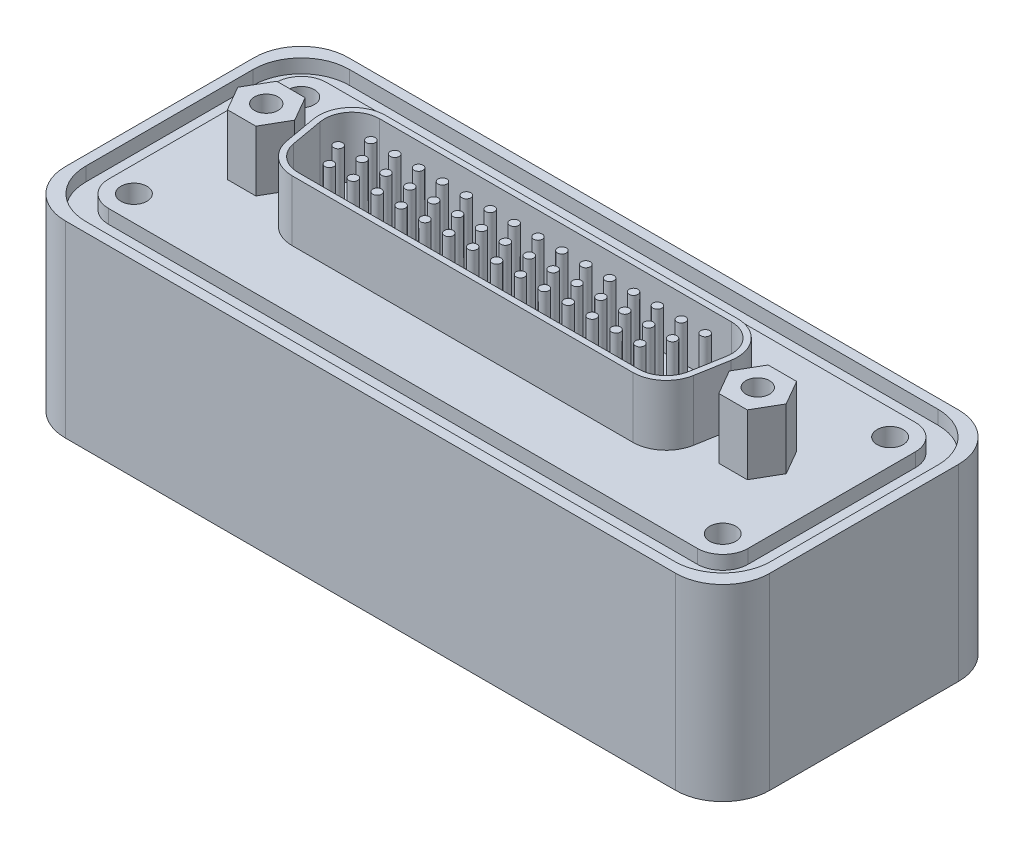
from build123d import *

# Parameters (mm, degrees)
SKETCH1_W                      = 67.42
SKETCH1_H                      = 27.08
BOSS_EXTRUDE1_DEPTH            = 9
FILLET1_R                      = 4.5
M3X0_5_TAPPED_HOLE1_AT_2_COUNT = 2
M3X0_5_TAPPED_HOLE1_AT_2_PITCH = 56.36
M3X0_5_TAPPED_HOLE1_AT_3_COUNT = 2
M3X0_5_TAPPED_HOLE1_AT_3_PITCH = 58.592576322
M3X0_5_TAPPED_HOLE1_AT_4_COUNT = 2
M3X0_5_TAPPED_HOLE1_AT_4_PITCH = 16.02
CUT_EXTRUDE1_DEPTH             = 1.3208
BOSS_EXTRUDE2_DEPTH            = 5.7912
F_4_40_TAPPED_HOLE1_D          = 2.2606
F_4_40_TAPPED_HOLE1_DEPTH      = 7.6
F_4_40_TAPPED_HOLE1_TIP        = 0.679152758
BOSS_EXTRUDE3_DEPTH            = 6.1658
F_4_40_TAPPED_HOLE2_D          = 2.2606
F_4_40_TAPPED_HOLE2_DEPTH      = 7.6
F_4_40_TAPPED_HOLE2_TIP        = 0.679152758
SKETCH11_R                     = 0.46355
CUT_EXTRUDE2_DEPTH             = 6
LPATTERN1_COUNT                = 15
LPATTERN1_PITCH                = 2.286
SKETCH12_R                     = 0.46355
CUT_EXTRUDE3_DEPTH             = 6
LPATTERN2_COUNT                = 14
LPATTERN2_PITCH                = 2.286
SKETCH13_R                     = 0.4223
BOSS_EXTRUDE4_DEPTH            = 5.7912
LPATTERN3_COUNT                = 15
LPATTERN3_PITCH                = 2.286
SKETCH14_R                     = 0.4223
BOSS_EXTRUDE5_DEPTH            = 5.7912
LPATTERN4_COUNT                = 14
LPATTERN4_PITCH                = 2.286


with BuildPart() as part:
    # Sketch1 → Boss-Extrude1 (new, symmetric)
    with BuildSketch(Plane(origin=(0, 0, 0), x_dir=(1, 0, 0), z_dir=(0, 1, 0))):
        Rectangle(SKETCH1_W, SKETCH1_H)
    extrude(amount=BOSS_EXTRUDE1_DEPTH, both=True)

    # Fillet1
    fillet1_edges = [part.edges().sort_by_distance(p)[0] for p in [
        (33.71, 0, 13.54),
        (-33.71, 0, 13.54),
        (-33.71, 0, -13.54),
        (33.71, 0, -13.54),
    ]]
    fillet(fillet1_edges, radius=FILLET1_R)

    # Sketch2 → M3x0.5 Tapped Hole1 (revolve, cut)
    with BuildSketch(Plane(origin=(-28.18, 9, -8.01), x_dir=(0, 0, 1), z_dir=(1, 0, 0))):
        Polygon((0, 0), (0, 8.251075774), (1.25, 7.5), (1.25, 0), align=None)
    m3x0_5_tapped_hole1 = revolve(axis=Axis((-28.18, 15.35, -8.01), (0, -1, 0)), mode=Mode.SUBTRACT)

    # M3x0.5 Tapped Hole1 at 2: M3x0.5 Tapped Hole1 ×2
    with Locations(*[(i * M3X0_5_TAPPED_HOLE1_AT_2_PITCH, 0, 0) for i in range(1, M3X0_5_TAPPED_HOLE1_AT_2_COUNT)]):
        add(m3x0_5_tapped_hole1, mode=Mode.SUBTRACT)

    # M3x0.5 Tapped Hole1 at 3: M3x0.5 Tapped Hole1 ×2
    with Locations(*[Vector(0.9618966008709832, 0, 0.2734134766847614) * (i * M3X0_5_TAPPED_HOLE1_AT_3_PITCH) for i in range(1, M3X0_5_TAPPED_HOLE1_AT_3_COUNT)]):
        add(m3x0_5_tapped_hole1, mode=Mode.SUBTRACT)

    # M3x0.5 Tapped Hole1 at 4: M3x0.5 Tapped Hole1 ×2
    with Locations(*[(0, 0, i * M3X0_5_TAPPED_HOLE1_AT_4_PITCH) for i in range(1, M3X0_5_TAPPED_HOLE1_AT_4_COUNT)]):
        add(m3x0_5_tapped_hole1, mode=Mode.SUBTRACT)

    # Sketch4 → Cut-Extrude1 (cut)
    with BuildSketch(Plane(origin=(0, 9, 0), x_dir=(1, 0, 0), z_dir=(0, 1, 0))):
        with BuildLine():
            Line((-28.18, 12.61), (28.18, 12.61))
            ThreePointArc((28.18, 12.61), (31.432691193, 11.262691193), (32.78, 8.01))
            Line((32.78, 8.01), (32.78, -8.01))
            ThreePointArc((32.78, -8.01), (31.432691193, -11.262691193), (28.18, -12.61))
            Line((28.18, -12.61), (-28.18, -12.61))
            ThreePointArc((-28.18, -12.61), (-31.432691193, -11.262691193), (-32.78, -8.01))
            Line((-32.78, -8.01), (-32.78, 8.01))
            ThreePointArc((-32.78, 8.01), (-31.432691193, 11.262691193), (-28.18, 12.61))
        make_face()
        with BuildLine():
            Line((-28.18, 10.4383), (28.18, 10.4383))
            ThreePointArc((28.18, 10.4383), (29.897067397, 9.727067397), (30.6083, 8.01))
            Line((30.6083, 8.01), (30.6083, -8.01))
            ThreePointArc((30.6083, -8.01), (29.897067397, -9.727067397), (28.18, -10.4383))
            Line((28.18, -10.4383), (-28.18, -10.4383))
            ThreePointArc((-28.18, -10.4383), (-29.897067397, -9.727067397), (-30.6083, -8.01))
            Line((-30.6083, -8.01), (-30.6083, 8.01))
            ThreePointArc((-30.6083, 8.01), (-29.897067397, 9.727067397), (-28.18, 10.4383))
        make_face(mode=Mode.SUBTRACT)
    cut_extrude1 = extrude(amount=-CUT_EXTRUDE1_DEPTH, mode=Mode.SUBTRACT)

    # Mirror1: M3x0.5 Tapped Hole1, Cut-Extrude1 across plane
    add(m3x0_5_tapped_hole1.mirror(Plane.ZX), mode=Mode.SUBTRACT)
    add(cut_extrude1.mirror(Plane.ZX), mode=Mode.SUBTRACT)

    # Mirror1 copy 1 sketch → Mirror1 copy 1 (revolve, cut)
    with BuildSketch(Plane(origin=(28.18, -9, -8.01), x_dir=(0, 0, 1), z_dir=(1, 0, 0))):
        Polygon((0, 0), (0, -8.251075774), (1.25, -7.5), (1.25, 0), align=None)
    revolve(axis=Axis((28.18, -15.35, -8.01), (0, -1, 0)), mode=Mode.SUBTRACT)

    # Mirror1 copy 2 sketch → Mirror1 copy 2 (revolve, cut)
    with BuildSketch(Plane(origin=(28.18, -9, 8.01), x_dir=(0, 0, 1), z_dir=(1, 0, 0))):
        Polygon((0, 0), (0, -8.251075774), (1.25, -7.5), (1.25, 0), align=None)
    revolve(axis=Axis((28.18, -15.35, 8.01), (0, -1, 0)), mode=Mode.SUBTRACT)

    # Mirror1 copy 3 sketch → Mirror1 copy 3 (revolve, cut)
    with BuildSketch(Plane(origin=(-28.18, -9, 8.01), x_dir=(0, 0, 1), z_dir=(1, 0, 0))):
        Polygon((0, 0), (0, -8.251075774), (1.25, -7.5), (1.25, 0), align=None)
    revolve(axis=Axis((-28.18, -15.35, 8.01), (0, -1, 0)), mode=Mode.SUBTRACT)

    # Sketch5 → Boss-Extrude2 (add)
    # profile 1 of 3: a face of its own
    with BuildSketch(Plane(origin=(0, 9, 0), x_dir=(1, 0, 0), z_dir=(0, 1, 0))):
        with BuildLine():
            Line((-16.8402, 4.7371), (16.8402, 4.7371))
            ThreePointArc((16.8402, 4.7371), (19.291841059, 3.593886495), (19.991982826, 0.980979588))
            Line((19.991982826, 0.980979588), (19.450082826, -2.092420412))
            ThreePointArc((19.450082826, -2.092420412), (18.355486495, -3.988341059), (16.2983, -4.7371))
            Line((16.2983, -4.7371), (-16.2983, -4.7371))
            ThreePointArc((-16.2983, -4.7371), (-18.355486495, -3.988341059), (-19.450082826, -2.092420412))
            Line((-19.450082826, -2.092420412), (-19.991982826, 0.980979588))
            ThreePointArc((-19.991982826, 0.980979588), (-19.291841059, 3.593886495), (-16.8402, 4.7371))
        make_face()
        with BuildLine():
            Line((-16.8402, 4.1783), (16.8402, 4.1783))
            ThreePointArc((16.8402, 4.1783), (18.863776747, 3.234695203), (19.441671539, 1.078010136))
            Line((19.441671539, 1.078010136), (18.899771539, -1.995389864))
            ThreePointArc((18.899771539, -1.995389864), (17.996295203, -3.560276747), (16.2983, -4.1783))
            Line((16.2983, -4.1783), (-16.2983, -4.1783))
            ThreePointArc((-16.2983, -4.1783), (-17.996295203, -3.560276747), (-18.899771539, -1.995389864))
            Line((-18.899771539, -1.995389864), (-19.441671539, 1.078010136))
            ThreePointArc((-19.441671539, 1.078010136), (-18.863776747, 3.234695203), (-16.8402, 4.1783))
        make_face(mode=Mode.SUBTRACT)
    # profile 2 of 3: a face of its own
    with BuildSketch(Plane(origin=(0, 9, 0), x_dir=(1, 0, 0), z_dir=(0, 1, 0))):
        Polygon((-20.795306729, 0), (-22.157853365, 2.36), (-24.882946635, 2.36), (-26.245493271, 0), (-24.882946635, -2.36), (-22.157853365, -2.36), align=None)
    # profile 3 of 3: a face of its own
    with BuildSketch(Plane(origin=(0, 9, 0), x_dir=(1, 0, 0), z_dir=(0, 1, 0))):
        Polygon((24.882946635, -2.36), (26.245493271, 0), (24.882946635, 2.36), (22.157853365, 2.36), (20.795306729, 0), (22.157853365, -2.36), align=None)
    extrude(amount=BOSS_EXTRUDE2_DEPTH)

    # 4-40 Tapped Hole1
    with Locations(Plane(origin=(0, 14.7912, 0), x_dir=(-1, 0, 0), z_dir=(0, 1, 0))):
        with Locations((23.5204, 0), (-23.5204, 0)):
            Hole(F_4_40_TAPPED_HOLE1_D / 2, depth=F_4_40_TAPPED_HOLE1_DEPTH)
            with Locations((0, 0, -(F_4_40_TAPPED_HOLE1_DEPTH + F_4_40_TAPPED_HOLE1_TIP / 2))):  # 118° drill point
                Cone(0, F_4_40_TAPPED_HOLE1_D / 2, F_4_40_TAPPED_HOLE1_TIP, mode=Mode.SUBTRACT)

    # Sketch8 → Boss-Extrude3 (add)
    with BuildSketch(Plane.XZ.offset(9)):
        with BuildLine():
            Line((16.6497, -3.9497), (-16.6497, -3.9497))
            ThreePointArc((-16.6497, -3.9497), (-18.595456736, -3.04237594), (-19.151109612, -0.968621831))
            Line((-19.151109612, -0.968621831), (-18.653959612, 1.850778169))
            ThreePointArc((-18.653959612, 1.850778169), (-17.78522594, 3.355456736), (-16.15255, 3.9497))
            Line((-16.15255, 3.9497), (16.15255, 3.9497))
            ThreePointArc((16.15255, 3.9497), (17.78522594, 3.355456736), (18.653959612, 1.850778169))
            Line((18.653959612, 1.850778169), (19.151109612, -0.968621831))
            ThreePointArc((19.151109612, -0.968621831), (18.595456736, -3.04237594), (16.6497, -3.9497))
        make_face()
        Polygon((22.157853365, 2.36), (20.795306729, 0), (22.157853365, -2.36), (24.882946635, -2.36), (26.245493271, 0), (24.882946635, 2.36), align=None)
        Polygon((-26.245493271, 0), (-24.882946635, -2.36), (-22.157853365, -2.36), (-20.795306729, 0), (-22.157853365, 2.36), (-24.882946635, 2.36), align=None)
    extrude(amount=BOSS_EXTRUDE3_DEPTH)

    # 4-40 Tapped Hole2
    with Locations(Plane.XZ.offset(15.1658)):
        with Locations((-23.5204, 0), (23.5204, 0)):
            Hole(F_4_40_TAPPED_HOLE2_D / 2, depth=F_4_40_TAPPED_HOLE2_DEPTH)
            with Locations((0, 0, -(F_4_40_TAPPED_HOLE2_DEPTH + F_4_40_TAPPED_HOLE2_TIP / 2))):  # 118° drill point
                Cone(0, F_4_40_TAPPED_HOLE2_D / 2, F_4_40_TAPPED_HOLE2_TIP, mode=Mode.SUBTRACT)

    # Sketch11 → Cut-Extrude2 (cut)
    with BuildSketch(Plane.XZ.offset(15.1658)):
        with Locations(Location((-16.637, 0, 0), (0, 0, 270))):
            Circle(SKETCH11_R)
        with Locations(Location((-15.494, -1.9812, 0), (0, 0, 270))):
            Circle(SKETCH11_R)
    cut_extrude2 = extrude(amount=-CUT_EXTRUDE2_DEPTH, mode=Mode.SUBTRACT)

    # LPattern1: Cut-Extrude2 ×15
    with Locations(*[(i * LPATTERN1_PITCH, 0, 0) for i in range(1, LPATTERN1_COUNT)]):
        add(cut_extrude2, mode=Mode.SUBTRACT)

    # Sketch12 → Cut-Extrude3 (cut)
    with BuildSketch(Plane.XZ.offset(15.1658)):
        with Locations(Location((-15.494, 1.9812, 0), (0, 0, 270))):
            Circle(SKETCH12_R)
    cut_extrude3 = extrude(amount=-CUT_EXTRUDE3_DEPTH, mode=Mode.SUBTRACT)

    # LPattern2: Cut-Extrude3 ×14
    with Locations(*[(i * LPATTERN2_PITCH, 0, 0) for i in range(1, LPATTERN2_COUNT)]):
        add(cut_extrude3, mode=Mode.SUBTRACT)

    # Sketch13 → Boss-Extrude4 (add)
    with BuildSketch(Plane(origin=(0, 9, 0), x_dir=(1, 0, 0), z_dir=(0, 1, 0))):
        with Locations(Location((-16.637, 0, 0), (0, 0, 90))):
            Circle(SKETCH13_R)
        with Locations(Location((-15.494, 1.9812, 0), (0, 0, 90))):
            Circle(SKETCH13_R)
    boss_extrude4 = extrude(amount=BOSS_EXTRUDE4_DEPTH)

    # LPattern3: Boss-Extrude4 ×15
    with Locations(*[(i * LPATTERN3_PITCH, 0, 0) for i in range(1, LPATTERN3_COUNT)]):
        add(boss_extrude4)

    # Sketch14 → Boss-Extrude5 (add)
    with BuildSketch(Plane(origin=(0, 9, 0), x_dir=(1, 0, 0), z_dir=(0, 1, 0))):
        with Locations(Location((-15.494, -1.9812, 0), (0, 0, 90))):
            Circle(SKETCH14_R)
    boss_extrude5 = extrude(amount=BOSS_EXTRUDE5_DEPTH)

    # LPattern4: Boss-Extrude5 ×14
    with Locations(*[(i * LPATTERN4_PITCH, 0, 0) for i in range(1, LPATTERN4_COUNT)]):
        add(boss_extrude5)


solid = part.part
